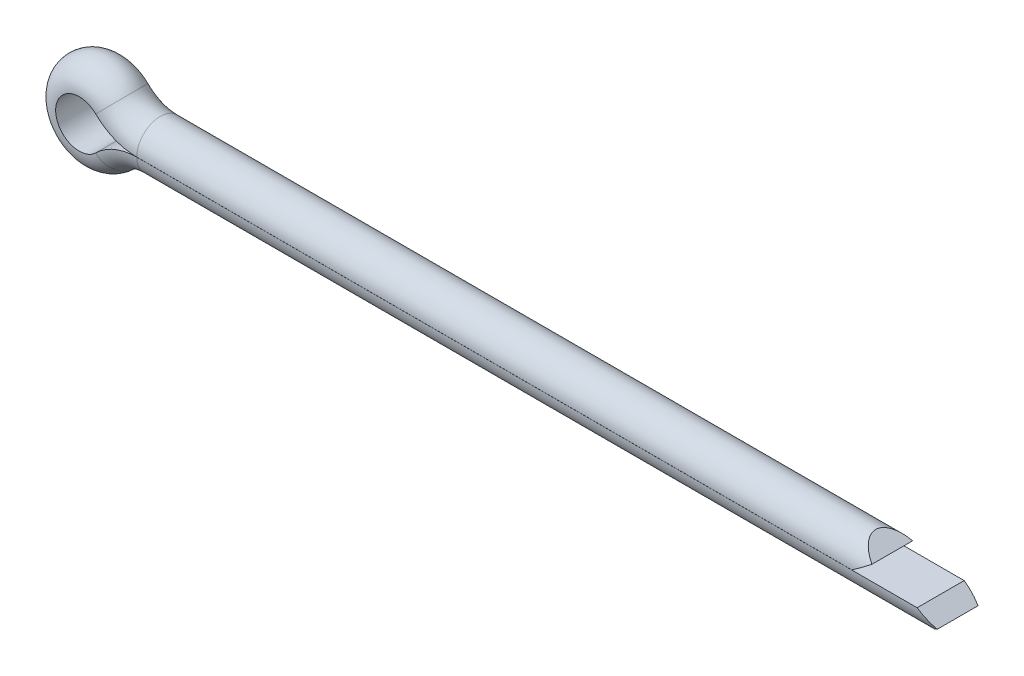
ISO-10303-21;
HEADER;
FILE_DESCRIPTION(('STEP AP214'),'2;1');
FILE_NAME('part.step','',(''),(''),'','','');
FILE_SCHEMA(('AUTOMOTIVE_DESIGN { 1 0 10303 214 1 1 1 1 }'));
ENDSEC;
DATA;
#1=APPLICATION_CONTEXT('core data for automotive mechanical design processes');
#2=APPLICATION_PROTOCOL_DEFINITION('international standard','automotive_design',2000,#1);
#3=PRODUCT_CONTEXT('',#1,'mechanical');
#4=PRODUCT('Part','Part','',(#3));
#5=PRODUCT_RELATED_PRODUCT_CATEGORY('part','',(#4));
#6=PRODUCT_DEFINITION_FORMATION('','',#4);
#7=PRODUCT_DEFINITION_CONTEXT('part definition',#1,'design');
#8=PRODUCT_DEFINITION('design','',#6,#7);
#9=PRODUCT_DEFINITION_SHAPE('','',#8);
#10=(LENGTH_UNIT() NAMED_UNIT(*) SI_UNIT(.MILLI.,.METRE.));
#11=(NAMED_UNIT(*) PLANE_ANGLE_UNIT() SI_UNIT($,.RADIAN.));
#12=(NAMED_UNIT(*) SI_UNIT($,.STERADIAN.) SOLID_ANGLE_UNIT());
#13=UNCERTAINTY_MEASURE_WITH_UNIT(LENGTH_MEASURE(1.E-05),#10,'distance_accuracy_value','');
#14=(GEOMETRIC_REPRESENTATION_CONTEXT(3) GLOBAL_UNCERTAINTY_ASSIGNED_CONTEXT((#13)) GLOBAL_UNIT_ASSIGNED_CONTEXT((#10,
#11,#12)) REPRESENTATION_CONTEXT('',''));
#15=CARTESIAN_POINT('',(0.,0.,0.));
#16=DIRECTION('',(0.,0.,1.));
#17=DIRECTION('',(1.,0.,0.));
#18=AXIS2_PLACEMENT_3D('',#15,#16,#17);
#19=CARTESIAN_POINT('',(0.,-0.00199999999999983,0.899997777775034));
#20=DIRECTION('',(0.,-1.,0.));
#21=DIRECTION('',(1.,0.,0.));
#22=AXIS2_PLACEMENT_3D('',#19,#20,#21);
#23=PLANE('',#22);
#24=DIRECTION('',(1.,0.,0.));
#25=VECTOR('',#24,1.);
#26=CARTESIAN_POINT('',(0.,-0.00199999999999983,0.899997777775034));
#27=LINE('',#26,#25);
#28=CARTESIAN_POINT('',(0.,-0.00199999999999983,0.899997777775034));
#29=VERTEX_POINT('',#28);
#30=CARTESIAN_POINT('',(29.8502858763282,-0.00200000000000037,0.899997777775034));
#31=VERTEX_POINT('',#30);
#32=EDGE_CURVE('E37',#29,#31,#27,.T.);
#33=ORIENTED_EDGE('',*,*,#32,.T.);
#34=DIRECTION('',(0.,0.,-1.));
#35=VECTOR('',#34,1.);
#36=CARTESIAN_POINT('',(29.8502858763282,-0.00200000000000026,0.899997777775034));
#37=LINE('',#36,#35);
#38=CARTESIAN_POINT('',(29.8502858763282,-0.00200000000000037,-0.899997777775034));
#39=VERTEX_POINT('',#38);
#40=EDGE_CURVE('E93',#31,#39,#37,.T.);
#41=ORIENTED_EDGE('',*,*,#40,.T.);
#42=DIRECTION('',(1.,0.,0.));
#43=VECTOR('',#42,1.);
#44=CARTESIAN_POINT('',(0.,-0.00199999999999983,-0.899997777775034));
#45=LINE('',#44,#43);
#46=CARTESIAN_POINT('',(0.,-0.00199999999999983,-0.899997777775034));
#47=VERTEX_POINT('',#46);
#48=EDGE_CURVE('E11',#47,#39,#45,.T.);
#49=ORIENTED_EDGE('',*,*,#48,.F.);
#50=DIRECTION('',(0.,0.,-1.));
#51=VECTOR('',#50,1.);
#52=CARTESIAN_POINT('',(0.,-0.00199999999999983,0.899997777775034));
#53=LINE('',#52,#51);
#54=EDGE_CURVE('E110',#29,#47,#53,.T.);
#55=ORIENTED_EDGE('',*,*,#54,.F.);
#56=EDGE_LOOP('',(#33,#41,#49,#55));
#57=FACE_BOUND('',#56,.T.);
#58=ADVANCED_FACE('F30',(#57),#23,.F.);
#59=CARTESIAN_POINT('',(0.,0.,0.));
#60=DIRECTION('',(1.,0.,0.));
#61=DIRECTION('',(0.,1.,0.));
#62=AXIS2_PLACEMENT_3D('',#59,#60,#61);
#63=CYLINDRICAL_SURFACE('',#62,0.9);
#64=CARTESIAN_POINT('',(31.1357297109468,0.,0.));
#65=DIRECTION('',(-0.578607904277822,0.815605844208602,0.));
#66=DIRECTION('',(0.815605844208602,0.578607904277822,0.));
#67=AXIS2_PLACEMENT_3D('',#64,#65,#66);
#68=ELLIPSE('',#67,1.55545749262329,0.9);
#69=CARTESIAN_POINT('',(30.5,-0.450999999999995,-0.778844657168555));
#70=VERTEX_POINT('',#69);
#71=CARTESIAN_POINT('',(30.5,-0.451000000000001,0.778844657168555));
#72=VERTEX_POINT('',#71);
#73=EDGE_CURVE('E107',#70,#72,#68,.T.);
#74=ORIENTED_EDGE('',*,*,#73,.T.);
#75=CARTESIAN_POINT('',(29.8473918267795,0.,0.));
#76=DIRECTION('',(-0.568523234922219,-0.822667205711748,0.));
#77=DIRECTION('',(0.822667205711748,-0.568523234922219,0.));
#78=AXIS2_PLACEMENT_3D('',#75,#76,#77);
#79=ELLIPSE('',#78,1.58304875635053,0.9);
#80=EDGE_CURVE('E96',#72,#31,#79,.T.);
#81=ORIENTED_EDGE('',*,*,#80,.T.);
#82=ORIENTED_EDGE('',*,*,#32,.F.);
#83=CARTESIAN_POINT('',(0.,0.,0.));
#84=DIRECTION('',(-1.,0.,0.));
#85=DIRECTION('',(0.,0.,-1.));
#86=AXIS2_PLACEMENT_3D('',#83,#84,#85);
#87=CIRCLE('',#86,0.9);
#88=EDGE_CURVE('E120',#47,#29,#87,.T.);
#89=ORIENTED_EDGE('',*,*,#88,.F.);
#90=ORIENTED_EDGE('',*,*,#48,.T.);
#91=EDGE_CURVE('E98',#39,#70,#79,.T.);
#92=ORIENTED_EDGE('',*,*,#91,.T.);
#93=EDGE_LOOP('',(#74,#81,#82,#89,#90,#92));
#94=FACE_BOUND('',#93,.T.);
#95=ADVANCED_FACE('F104',(#94),#63,.T.);
#96=CARTESIAN_POINT('',(0.,-2.23888888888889,0.));
#97=DIRECTION('',(0.,0.,-1.));
#98=DIRECTION('',(-1.,0.,0.));
#99=AXIS2_PLACEMENT_3D('',#96,#97,#98);
#100=CYLINDRICAL_SURFACE('',#99,2.23688888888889);
#101=DIRECTION('',(0.,0.,-1.));
#102=VECTOR('',#101,1.);
#103=CARTESIAN_POINT('',(-1.5678017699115,-0.643373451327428,0.899997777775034));
#104=LINE('',#103,#102);
#105=CARTESIAN_POINT('',(-1.5678017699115,-0.643373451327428,0.899997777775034));
#106=VERTEX_POINT('',#105);
#107=CARTESIAN_POINT('',(-1.5678017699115,-0.643373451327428,-0.899997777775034));
#108=VERTEX_POINT('',#107);
#109=EDGE_CURVE('E128',#106,#108,#104,.T.);
#110=ORIENTED_EDGE('',*,*,#109,.F.);
#111=CARTESIAN_POINT('',(0.,-2.23888888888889,0.899997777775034));
#112=DIRECTION('',(0.,0.,-1.));
#113=DIRECTION('',(-1.,0.,0.));
#114=AXIS2_PLACEMENT_3D('',#111,#112,#113);
#115=CIRCLE('',#114,2.23688888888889);
#116=EDGE_CURVE('E114',#106,#29,#115,.T.);
#117=ORIENTED_EDGE('',*,*,#116,.T.);
#118=ORIENTED_EDGE('',*,*,#54,.T.);
#119=CARTESIAN_POINT('',(0.,-2.23888888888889,-0.899997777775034));
#120=DIRECTION('',(0.,0.,-1.));
#121=DIRECTION('',(-1.,0.,0.));
#122=AXIS2_PLACEMENT_3D('',#119,#120,#121);
#123=CIRCLE('',#122,2.23688888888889);
#124=EDGE_CURVE('E112',#108,#47,#123,.T.);
#125=ORIENTED_EDGE('',*,*,#124,.F.);
#126=EDGE_LOOP('',(#110,#117,#118,#125));
#127=FACE_BOUND('',#126,.T.);
#128=ADVANCED_FACE('F193',(#127),#100,.T.);
#129=CARTESIAN_POINT('',(0.,-2.23888888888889,0.));
#130=DIRECTION('',(0.,0.,-1.));
#131=DIRECTION('',(-1.,0.,0.));
#132=AXIS2_PLACEMENT_3D('',#129,#130,#131);
#133=TOROIDAL_SURFACE('',#132,2.23888888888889,0.9);
#134=CARTESIAN_POINT('',(-1.569203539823,-0.641946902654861,0.));
#135=DIRECTION('',(-0.713274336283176,-0.700884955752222,0.));
#136=DIRECTION('',(0.,0.,-1.));
#137=AXIS2_PLACEMENT_3D('',#134,#135,#136);
#138=CIRCLE('',#137,0.9);
#139=EDGE_CURVE('E131',#108,#106,#138,.T.);
#140=ORIENTED_EDGE('',*,*,#139,.F.);
#141=ORIENTED_EDGE('',*,*,#124,.T.);
#142=ORIENTED_EDGE('',*,*,#88,.T.);
#143=ORIENTED_EDGE('',*,*,#116,.F.);
#144=EDGE_LOOP('',(#140,#141,#142,#143));
#145=FACE_BOUND('',#144,.T.);
#146=ADVANCED_FACE('F195',(#145),#133,.T.);
#147=CARTESIAN_POINT('',(-2.2,0.,0.));
#148=DIRECTION('',(0.,0.,1.));
#149=DIRECTION('',(1.,0.,0.));
#150=AXIS2_PLACEMENT_3D('',#147,#148,#149);
#151=CYLINDRICAL_SURFACE('',#150,0.902);
#152=DIRECTION('',(0.,0.,-1.));
#153=VECTOR('',#152,1.);
#154=CARTESIAN_POINT('',(-1.5678017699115,0.643373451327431,0.899997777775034));
#155=LINE('',#154,#153);
#156=CARTESIAN_POINT('',(-1.5678017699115,0.643373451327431,0.899997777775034));
#157=VERTEX_POINT('',#156);
#158=CARTESIAN_POINT('',(-1.5678017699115,0.643373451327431,-0.899997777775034));
#159=VERTEX_POINT('',#158);
#160=EDGE_CURVE('E140',#157,#159,#155,.T.);
#161=ORIENTED_EDGE('',*,*,#160,.F.);
#162=CARTESIAN_POINT('',(-2.2,0.,0.899997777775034));
#163=DIRECTION('',(0.,0.,1.));
#164=DIRECTION('',(1.,0.,0.));
#165=AXIS2_PLACEMENT_3D('',#162,#163,#164);
#166=CIRCLE('',#165,0.902);
#167=EDGE_CURVE('E125',#157,#106,#166,.T.);
#168=ORIENTED_EDGE('',*,*,#167,.T.);
#169=ORIENTED_EDGE('',*,*,#109,.T.);
#170=CARTESIAN_POINT('',(-2.2,0.,-0.899997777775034));
#171=DIRECTION('',(0.,0.,1.));
#172=DIRECTION('',(1.,0.,0.));
#173=AXIS2_PLACEMENT_3D('',#170,#171,#172);
#174=CIRCLE('',#173,0.902);
#175=EDGE_CURVE('E122',#159,#108,#174,.T.);
#176=ORIENTED_EDGE('',*,*,#175,.F.);
#177=EDGE_LOOP('',(#161,#168,#169,#176));
#178=FACE_BOUND('',#177,.T.);
#179=ADVANCED_FACE('F190',(#178),#151,.F.);
#180=CARTESIAN_POINT('',(-2.2,0.,0.));
#181=DIRECTION('',(0.,0.,1.));
#182=DIRECTION('',(1.,0.,0.));
#183=AXIS2_PLACEMENT_3D('',#180,#181,#182);
#184=TOROIDAL_SURFACE('',#183,0.9,0.9);
#185=CARTESIAN_POINT('',(-1.56920353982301,0.641946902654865,0.));
#186=DIRECTION('',(0.713274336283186,-0.700884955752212,0.));
#187=DIRECTION('',(0.,0.,-1.));
#188=AXIS2_PLACEMENT_3D('',#185,#186,#187);
#189=CIRCLE('',#188,0.9);
#190=EDGE_CURVE('E143',#159,#157,#189,.T.);
#191=ORIENTED_EDGE('',*,*,#190,.F.);
#192=ORIENTED_EDGE('',*,*,#175,.T.);
#193=ORIENTED_EDGE('',*,*,#139,.T.);
#194=ORIENTED_EDGE('',*,*,#167,.F.);
#195=EDGE_LOOP('',(#191,#192,#193,#194));
#196=FACE_BOUND('',#195,.T.);
#197=ADVANCED_FACE('F187',(#196),#184,.T.);
#198=CARTESIAN_POINT('',(0.,2.23888888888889,0.));
#199=DIRECTION('',(0.,0.,-1.));
#200=DIRECTION('',(-1.,0.,0.));
#201=AXIS2_PLACEMENT_3D('',#198,#199,#200);
#202=CYLINDRICAL_SURFACE('',#201,2.23688888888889);
#203=DIRECTION('',(0.,0.,-1.));
#204=VECTOR('',#203,1.);
#205=CARTESIAN_POINT('',(0.,0.002,0.899997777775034));
#206=LINE('',#205,#204);
#207=CARTESIAN_POINT('',(0.,0.002,0.899997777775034));
#208=VERTEX_POINT('',#207);
#209=CARTESIAN_POINT('',(0.,0.002,-0.899997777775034));
#210=VERTEX_POINT('',#209);
#211=EDGE_CURVE('E150',#208,#210,#206,.T.);
#212=ORIENTED_EDGE('',*,*,#211,.F.);
#213=CARTESIAN_POINT('',(0.,2.23888888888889,0.899997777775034));
#214=DIRECTION('',(0.,0.,-1.));
#215=DIRECTION('',(-1.,0.,0.));
#216=AXIS2_PLACEMENT_3D('',#213,#214,#215);
#217=CIRCLE('',#216,2.23688888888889);
#218=EDGE_CURVE('E137',#208,#157,#217,.T.);
#219=ORIENTED_EDGE('',*,*,#218,.T.);
#220=ORIENTED_EDGE('',*,*,#160,.T.);
#221=CARTESIAN_POINT('',(0.,2.23888888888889,-0.899997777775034));
#222=DIRECTION('',(0.,0.,-1.));
#223=DIRECTION('',(-1.,0.,0.));
#224=AXIS2_PLACEMENT_3D('',#221,#222,#223);
#225=CIRCLE('',#224,2.23688888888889);
#226=EDGE_CURVE('E134',#210,#159,#225,.T.);
#227=ORIENTED_EDGE('',*,*,#226,.F.);
#228=EDGE_LOOP('',(#212,#219,#220,#227));
#229=FACE_BOUND('',#228,.T.);
#230=ADVANCED_FACE('F181',(#229),#202,.T.);
#231=CARTESIAN_POINT('',(0.,2.23888888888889,0.));
#232=DIRECTION('',(0.,0.,-1.));
#233=DIRECTION('',(-1.,0.,0.));
#234=AXIS2_PLACEMENT_3D('',#231,#232,#233);
#235=TOROIDAL_SURFACE('',#234,2.23888888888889,0.9);
#236=CARTESIAN_POINT('',(0.,0.,0.));
#237=DIRECTION('',(1.,0.,0.));
#238=DIRECTION('',(0.,0.,-1.));
#239=AXIS2_PLACEMENT_3D('',#236,#237,#238);
#240=CIRCLE('',#239,0.9);
#241=EDGE_CURVE('E155',#210,#208,#240,.T.);
#242=ORIENTED_EDGE('',*,*,#241,.F.);
#243=ORIENTED_EDGE('',*,*,#226,.T.);
#244=ORIENTED_EDGE('',*,*,#190,.T.);
#245=ORIENTED_EDGE('',*,*,#218,.F.);
#246=EDGE_LOOP('',(#242,#243,#244,#245));
#247=FACE_BOUND('',#246,.T.);
#248=ADVANCED_FACE('F184',(#247),#235,.T.);
#249=CARTESIAN_POINT('',(0.,0.,0.));
#250=DIRECTION('',(1.,0.,0.));
#251=DIRECTION('',(0.,0.,-1.));
#252=AXIS2_PLACEMENT_3D('',#249,#250,#251);
#253=CYLINDRICAL_SURFACE('',#252,0.9);
#254=CARTESIAN_POINT('',(27.3473918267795,0.,0.));
#255=DIRECTION('',(-0.568523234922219,0.822667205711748,0.));
#256=DIRECTION('',(0.822667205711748,0.568523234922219,0.));
#257=AXIS2_PLACEMENT_3D('',#254,#255,#256);
#258=ELLIPSE('',#257,1.58304875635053,0.9);
#259=CARTESIAN_POINT('',(28.,0.451,0.778844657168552));
#260=VERTEX_POINT('',#259);
#261=CARTESIAN_POINT('',(27.3502858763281,0.002,0.899997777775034));
#262=VERTEX_POINT('',#261);
#263=EDGE_CURVE('E44',#260,#262,#258,.F.);
#264=ORIENTED_EDGE('',*,*,#263,.F.);
#265=CARTESIAN_POINT('',(28.6357297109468,0.,0.));
#266=DIRECTION('',(-0.578607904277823,-0.815605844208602,0.));
#267=DIRECTION('',(0.815605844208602,-0.578607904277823,0.));
#268=AXIS2_PLACEMENT_3D('',#265,#266,#267);
#269=ELLIPSE('',#268,1.55545749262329,0.9);
#270=CARTESIAN_POINT('',(28.,0.451,-0.778844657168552));
#271=VERTEX_POINT('',#270);
#272=EDGE_CURVE('E163',#271,#260,#269,.F.);
#273=ORIENTED_EDGE('',*,*,#272,.F.);
#274=CARTESIAN_POINT('',(27.3502858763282,0.00200000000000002,-0.899997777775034));
#275=VERTEX_POINT('',#274);
#276=EDGE_CURVE('E159',#275,#271,#258,.F.);
#277=ORIENTED_EDGE('',*,*,#276,.F.);
#278=DIRECTION('',(1.,0.,0.));
#279=VECTOR('',#278,1.);
#280=CARTESIAN_POINT('',(0.,0.002,-0.899997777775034));
#281=LINE('',#280,#279);
#282=EDGE_CURVE('E146',#210,#275,#281,.T.);
#283=ORIENTED_EDGE('',*,*,#282,.F.);
#284=ORIENTED_EDGE('',*,*,#241,.T.);
#285=DIRECTION('',(1.,0.,0.));
#286=VECTOR('',#285,1.);
#287=CARTESIAN_POINT('',(0.,0.002,0.899997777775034));
#288=LINE('',#287,#286);
#289=EDGE_CURVE('E147',#208,#262,#288,.T.);
#290=ORIENTED_EDGE('',*,*,#289,.T.);
#291=EDGE_LOOP('',(#264,#273,#277,#283,#284,#290));
#292=FACE_BOUND('',#291,.T.);
#293=ADVANCED_FACE('F173',(#292),#253,.T.);
#294=CARTESIAN_POINT('',(0.,0.002,0.899997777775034));
#295=DIRECTION('',(0.,-1.,0.));
#296=DIRECTION('',(0.,0.,-1.));
#297=AXIS2_PLACEMENT_3D('',#294,#295,#296);
#298=PLANE('',#297);
#299=DIRECTION('',(0.,0.,-1.));
#300=VECTOR('',#299,1.);
#301=CARTESIAN_POINT('',(27.3502858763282,0.002,0.899997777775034));
#302=LINE('',#301,#300);
#303=EDGE_CURVE('E161',#262,#275,#302,.T.);
#304=ORIENTED_EDGE('',*,*,#303,.F.);
#305=ORIENTED_EDGE('',*,*,#289,.F.);
#306=ORIENTED_EDGE('',*,*,#211,.T.);
#307=ORIENTED_EDGE('',*,*,#282,.T.);
#308=EDGE_LOOP('',(#304,#305,#306,#307));
#309=FACE_BOUND('',#308,.T.);
#310=ADVANCED_FACE('F178',(#309),#298,.T.);
#311=CARTESIAN_POINT('',(28.,0.451,-0.899997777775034));
#312=DIRECTION('',(-0.568523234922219,0.822667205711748,0.));
#313=DIRECTION('',(-0.822667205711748,-0.568523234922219,0.));
#314=AXIS2_PLACEMENT_3D('',#311,#312,#313);
#315=PLANE('',#314);
#316=ORIENTED_EDGE('',*,*,#263,.T.);
#317=ORIENTED_EDGE('',*,*,#303,.T.);
#318=ORIENTED_EDGE('',*,*,#276,.T.);
#319=DIRECTION('',(0.,0.,1.));
#320=VECTOR('',#319,1.);
#321=CARTESIAN_POINT('',(28.,0.451,-0.899997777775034));
#322=LINE('',#321,#320);
#323=EDGE_CURVE('E165',#271,#260,#322,.T.);
#324=ORIENTED_EDGE('',*,*,#323,.T.);
#325=EDGE_LOOP('',(#316,#317,#318,#324));
#326=FACE_BOUND('',#325,.T.);
#327=ADVANCED_FACE('F168',(#326),#315,.F.);
#328=CARTESIAN_POINT('',(28.,0.451,-0.899997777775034));
#329=DIRECTION('',(-0.578607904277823,-0.815605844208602,0.));
#330=DIRECTION('',(0.815605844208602,-0.578607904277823,0.));
#331=AXIS2_PLACEMENT_3D('',#328,#329,#330);
#332=PLANE('',#331);
#333=ORIENTED_EDGE('',*,*,#272,.T.);
#334=ORIENTED_EDGE('',*,*,#323,.F.);
#335=EDGE_LOOP('',(#333,#334));
#336=FACE_BOUND('',#335,.T.);
#337=ADVANCED_FACE('F274',(#336),#332,.F.);
#338=CARTESIAN_POINT('',(30.5,-0.451000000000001,-0.899997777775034));
#339=DIRECTION('',(-0.578607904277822,0.815605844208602,0.));
#340=DIRECTION('',(-0.815605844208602,-0.578607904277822,0.));
#341=AXIS2_PLACEMENT_3D('',#338,#339,#340);
#342=PLANE('',#341);
#343=DIRECTION('',(0.,0.,1.));
#344=VECTOR('',#343,1.);
#345=CARTESIAN_POINT('',(30.5,-0.451000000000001,-0.899997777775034));
#346=LINE('',#345,#344);
#347=EDGE_CURVE('E52',#70,#72,#346,.T.);
#348=ORIENTED_EDGE('',*,*,#347,.T.);
#349=ORIENTED_EDGE('',*,*,#73,.F.);
#350=EDGE_LOOP('',(#348,#349));
#351=FACE_BOUND('',#350,.T.);
#352=ADVANCED_FACE('F281',(#351),#342,.F.);
#353=CARTESIAN_POINT('',(30.5,-0.451000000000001,-0.899997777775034));
#354=DIRECTION('',(-0.568523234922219,-0.822667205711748,0.));
#355=DIRECTION('',(0.822667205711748,-0.568523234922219,0.));
#356=AXIS2_PLACEMENT_3D('',#353,#354,#355);
#357=PLANE('',#356);
#358=ORIENTED_EDGE('',*,*,#347,.F.);
#359=ORIENTED_EDGE('',*,*,#91,.F.);
#360=ORIENTED_EDGE('',*,*,#40,.F.);
#361=ORIENTED_EDGE('',*,*,#80,.F.);
#362=EDGE_LOOP('',(#358,#359,#360,#361));
#363=FACE_BOUND('',#362,.T.);
#364=ADVANCED_FACE('F95',(#363),#357,.F.);
#365=CLOSED_SHELL('',(#58,#95,#128,#146,#179,#197,#230,#248,#293,#310,#327,#337,#352,#364));
#366=MANIFOLD_SOLID_BREP('B2',#365);
#367=ADVANCED_BREP_SHAPE_REPRESENTATION('',(#18,#366),#14);
#368=SHAPE_DEFINITION_REPRESENTATION(#9,#367);
ENDSEC;
END-ISO-10303-21;
